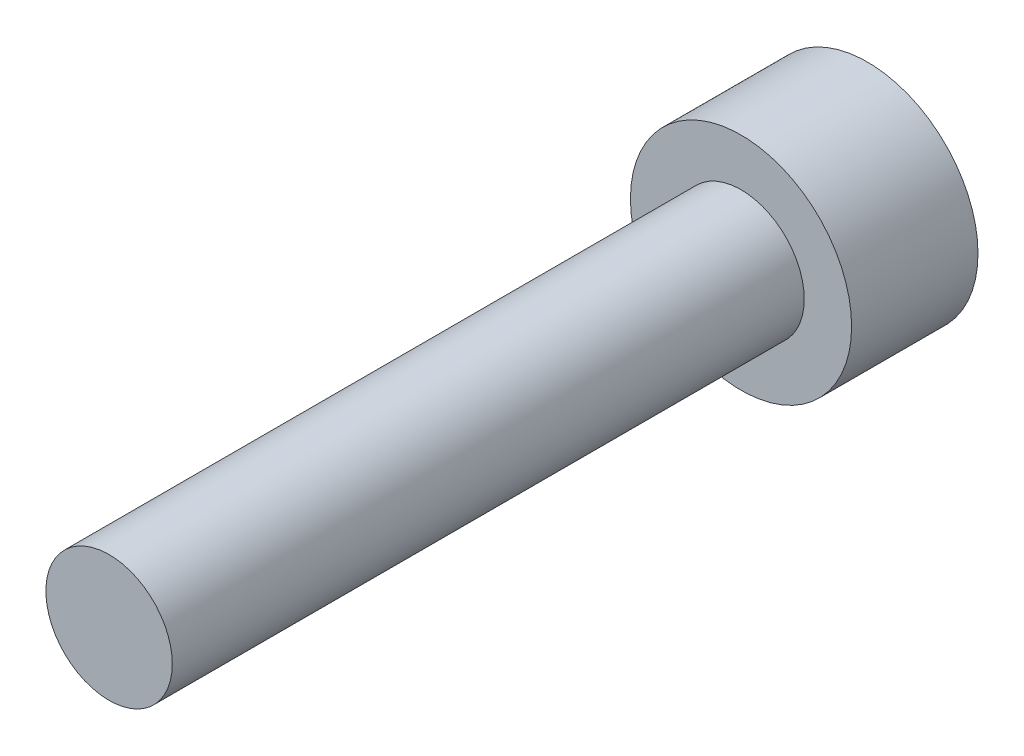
from build123d import *

# Parameters (mm, degrees)
HEX_2_DEPTH = 3


with BuildPart() as part:
    # Sketch6 → Revolve1 (revolve)
    with BuildSketch(Plane(origin=(0, 0, 0), x_dir=(0, 0, -1), z_dir=(1, 0, 0)), mode=Mode.PRIVATE) as revolve1_sk:
        Polygon((-20, 0), (-20, -2), (0, -2), (0, -3.5), (4, -3.5), (4, 0), align=None)
    revolve(revolve1_sk.sketch.rotate(Axis((0, 0, 20), (0, 0, -1)), 270), axis=Axis((0, 0, 20), (0, 0, -1)))

    # Sketch7 → HEX 2 (cut)
    with BuildSketch(Plane(origin=(0, 0, -4), x_dir=(-1, 0, 0), z_dir=(0, 0, -1))):
        Polygon((-1.5, 0.866025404), (-1.5, -0.866025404), (0, -1.732050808), (1.5, -0.866025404), (1.5, 0.866025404), (0, 1.732050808), align=None)
    extrude(amount=-HEX_2_DEPTH, mode=Mode.SUBTRACT)


solid = part.part
